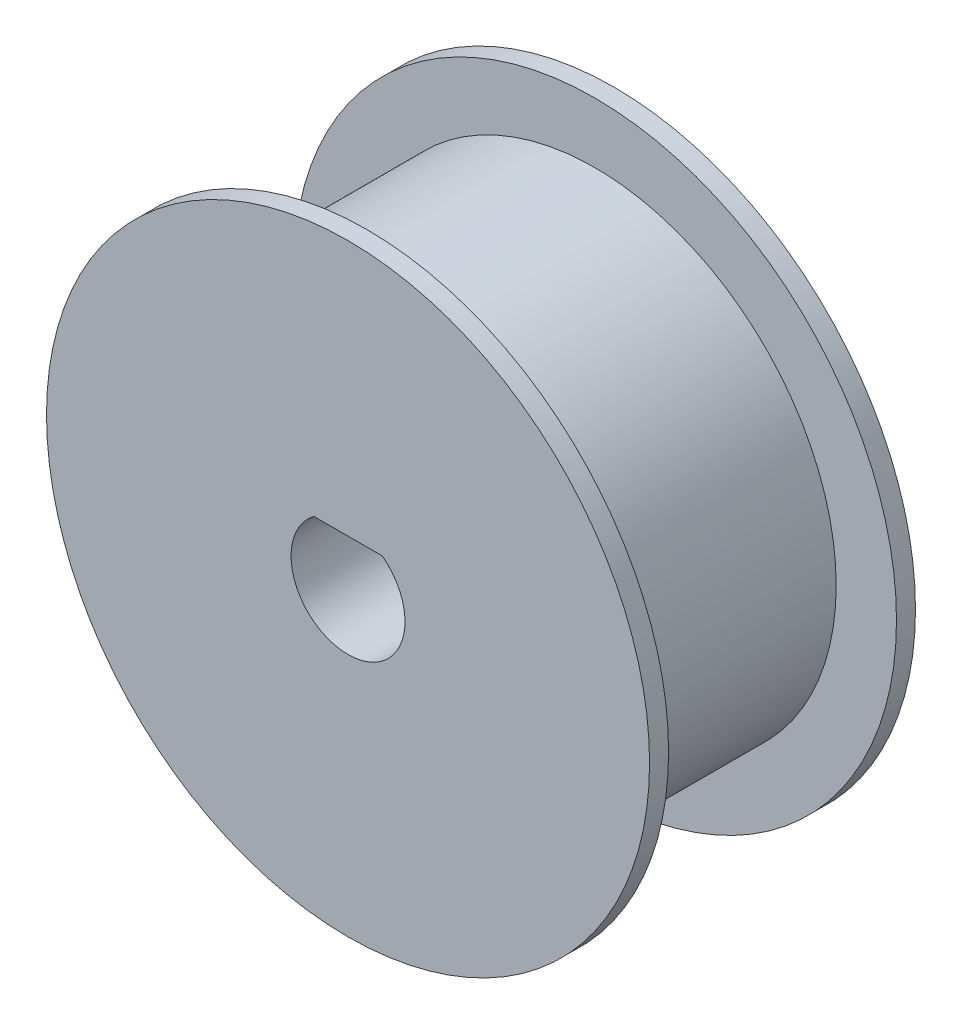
ISO-10303-21;
HEADER;
FILE_DESCRIPTION(('STEP AP214'),'2;1');
FILE_NAME('part.step','',(''),(''),'','','');
FILE_SCHEMA(('AUTOMOTIVE_DESIGN { 1 0 10303 214 1 1 1 1 }'));
ENDSEC;
DATA;
#1=APPLICATION_CONTEXT('core data for automotive mechanical design processes');
#2=APPLICATION_PROTOCOL_DEFINITION('international standard','automotive_design',2000,#1);
#3=PRODUCT_CONTEXT('',#1,'mechanical');
#4=PRODUCT('Part','Part','',(#3));
#5=PRODUCT_RELATED_PRODUCT_CATEGORY('part','',(#4));
#6=PRODUCT_DEFINITION_FORMATION('','',#4);
#7=PRODUCT_DEFINITION_CONTEXT('part definition',#1,'design');
#8=PRODUCT_DEFINITION('design','',#6,#7);
#9=PRODUCT_DEFINITION_SHAPE('','',#8);
#10=(LENGTH_UNIT() NAMED_UNIT(*) SI_UNIT(.MILLI.,.METRE.));
#11=(NAMED_UNIT(*) PLANE_ANGLE_UNIT() SI_UNIT($,.RADIAN.));
#12=(NAMED_UNIT(*) SI_UNIT($,.STERADIAN.) SOLID_ANGLE_UNIT());
#13=UNCERTAINTY_MEASURE_WITH_UNIT(LENGTH_MEASURE(1.E-05),#10,'distance_accuracy_value','');
#14=(GEOMETRIC_REPRESENTATION_CONTEXT(3) GLOBAL_UNCERTAINTY_ASSIGNED_CONTEXT((#13)) GLOBAL_UNIT_ASSIGNED_CONTEXT((#10,
#11,#12)) REPRESENTATION_CONTEXT('',''));
#15=CARTESIAN_POINT('',(0.,0.,0.));
#16=DIRECTION('',(0.,0.,1.));
#17=DIRECTION('',(1.,0.,0.));
#18=AXIS2_PLACEMENT_3D('',#15,#16,#17);
#19=CARTESIAN_POINT('',(0.,0.,12.));
#20=DIRECTION('',(0.,0.,-1.));
#21=DIRECTION('',(-1.,0.,0.));
#22=AXIS2_PLACEMENT_3D('',#19,#20,#21);
#23=CYLINDRICAL_SURFACE('',#22,12.7);
#24=CARTESIAN_POINT('',(0.,0.,12.));
#25=DIRECTION('',(0.,0.,1.));
#26=DIRECTION('',(1.,0.,0.));
#27=AXIS2_PLACEMENT_3D('',#24,#25,#26);
#28=CIRCLE('',#27,12.7);
#29=CARTESIAN_POINT('',(12.7,0.,12.));
#30=VERTEX_POINT('',#29);
#31=EDGE_CURVE('E11',#30,#30,#28,.T.);
#32=ORIENTED_EDGE('',*,*,#31,.F.);
#33=EDGE_LOOP('',(#32));
#34=FACE_BOUND('',#33,.T.);
#35=CARTESIAN_POINT('',(0.,0.,0.));
#36=DIRECTION('',(0.,0.,1.));
#37=DIRECTION('',(1.,0.,0.));
#38=AXIS2_PLACEMENT_3D('',#35,#36,#37);
#39=CIRCLE('',#38,12.7);
#40=CARTESIAN_POINT('',(12.7,0.,0.));
#41=VERTEX_POINT('',#40);
#42=EDGE_CURVE('E48',#41,#41,#39,.T.);
#43=ORIENTED_EDGE('',*,*,#42,.T.);
#44=EDGE_LOOP('',(#43));
#45=FACE_BOUND('',#44,.T.);
#46=ADVANCED_FACE('F45',(#34,#45),#23,.T.);
#47=CARTESIAN_POINT('',(0.,0.,12.));
#48=DIRECTION('',(0.,0.,-1.));
#49=DIRECTION('',(-1.,0.,0.));
#50=AXIS2_PLACEMENT_3D('',#47,#48,#49);
#51=CYLINDRICAL_SURFACE('',#50,3.);
#52=DIRECTION('',(0.,0.,1.));
#53=VECTOR('',#52,1.);
#54=CARTESIAN_POINT('',(-1.8,2.4,-4.64965751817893));
#55=LINE('',#54,#53);
#56=CARTESIAN_POINT('',(-1.8,2.4,-1.));
#57=VERTEX_POINT('',#56);
#58=CARTESIAN_POINT('',(-1.8,2.4,13.));
#59=VERTEX_POINT('',#58);
#60=EDGE_CURVE('E61',#57,#59,#55,.T.);
#61=ORIENTED_EDGE('',*,*,#60,.T.);
#62=CARTESIAN_POINT('',(0.,0.,13.));
#63=DIRECTION('',(0.,0.,1.));
#64=DIRECTION('',(1.,0.,0.));
#65=AXIS2_PLACEMENT_3D('',#62,#63,#64);
#66=CIRCLE('',#65,3.);
#67=CARTESIAN_POINT('',(1.8,2.4,13.));
#68=VERTEX_POINT('',#67);
#69=EDGE_CURVE('E65',#59,#68,#66,.T.);
#70=ORIENTED_EDGE('',*,*,#69,.T.);
#71=DIRECTION('',(0.,0.,1.));
#72=VECTOR('',#71,1.);
#73=CARTESIAN_POINT('',(1.8,2.4,-4.64965751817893));
#74=LINE('',#73,#72);
#75=CARTESIAN_POINT('',(1.8,2.4,-1.));
#76=VERTEX_POINT('',#75);
#77=EDGE_CURVE('E80',#76,#68,#74,.T.);
#78=ORIENTED_EDGE('',*,*,#77,.F.);
#79=CARTESIAN_POINT('',(0.,0.,-1.));
#80=DIRECTION('',(0.,0.,-1.));
#81=DIRECTION('',(-1.,0.,0.));
#82=AXIS2_PLACEMENT_3D('',#79,#80,#81);
#83=CIRCLE('',#82,3.);
#84=EDGE_CURVE('E73',#76,#57,#83,.T.);
#85=ORIENTED_EDGE('',*,*,#84,.T.);
#86=EDGE_LOOP('',(#61,#70,#78,#85));
#87=FACE_BOUND('',#86,.T.);
#88=ADVANCED_FACE('F81',(#87),#51,.F.);
#89=CARTESIAN_POINT('',(0.,0.,13.));
#90=DIRECTION('',(0.,0.,1.));
#91=DIRECTION('',(1.,0.,0.));
#92=AXIS2_PLACEMENT_3D('',#89,#90,#91);
#93=PLANE('',#92);
#94=CARTESIAN_POINT('',(0.,0.,13.));
#95=DIRECTION('',(0.,0.,1.));
#96=DIRECTION('',(1.,0.,0.));
#97=AXIS2_PLACEMENT_3D('',#94,#95,#96);
#98=CIRCLE('',#97,15.875);
#99=CARTESIAN_POINT('',(15.875,0.,13.));
#100=VERTEX_POINT('',#99);
#101=EDGE_CURVE('E54',#100,#100,#98,.T.);
#102=ORIENTED_EDGE('',*,*,#101,.T.);
#103=EDGE_LOOP('',(#102));
#104=FACE_BOUND('',#103,.T.);
#105=ORIENTED_EDGE('',*,*,#69,.F.);
#106=DIRECTION('',(1.,0.,0.));
#107=VECTOR('',#106,1.);
#108=CARTESIAN_POINT('',(-1.8,2.4,13.));
#109=LINE('',#108,#107);
#110=EDGE_CURVE('E89',#59,#68,#109,.T.);
#111=ORIENTED_EDGE('',*,*,#110,.T.);
#112=EDGE_LOOP('',(#105,#111));
#113=FACE_BOUND('',#112,.T.);
#114=ADVANCED_FACE('F117',(#104,#113),#93,.T.);
#115=CARTESIAN_POINT('',(0.,0.,12.));
#116=DIRECTION('',(0.,0.,1.));
#117=DIRECTION('',(1.,0.,0.));
#118=AXIS2_PLACEMENT_3D('',#115,#116,#117);
#119=PLANE('',#118);
#120=ORIENTED_EDGE('',*,*,#31,.T.);
#121=EDGE_LOOP('',(#120));
#122=FACE_BOUND('',#121,.T.);
#123=CARTESIAN_POINT('',(0.,0.,12.));
#124=DIRECTION('',(0.,0.,1.));
#125=DIRECTION('',(1.,0.,0.));
#126=AXIS2_PLACEMENT_3D('',#123,#124,#125);
#127=CIRCLE('',#126,15.875);
#128=CARTESIAN_POINT('',(15.875,0.,12.));
#129=VERTEX_POINT('',#128);
#130=EDGE_CURVE('E105',#129,#129,#127,.T.);
#131=ORIENTED_EDGE('',*,*,#130,.F.);
#132=EDGE_LOOP('',(#131));
#133=FACE_BOUND('',#132,.T.);
#134=ADVANCED_FACE('F115',(#122,#133),#119,.F.);
#135=CARTESIAN_POINT('',(0.,0.,13.));
#136=DIRECTION('',(0.,0.,-1.));
#137=DIRECTION('',(-1.,0.,0.));
#138=AXIS2_PLACEMENT_3D('',#135,#136,#137);
#139=CYLINDRICAL_SURFACE('',#138,15.875);
#140=ORIENTED_EDGE('',*,*,#101,.F.);
#141=EDGE_LOOP('',(#140));
#142=FACE_BOUND('',#141,.T.);
#143=ORIENTED_EDGE('',*,*,#130,.T.);
#144=EDGE_LOOP('',(#143));
#145=FACE_BOUND('',#144,.T.);
#146=ADVANCED_FACE('F113',(#142,#145),#139,.T.);
#147=CARTESIAN_POINT('',(0.,0.,-1.));
#148=DIRECTION('',(0.,0.,-1.));
#149=DIRECTION('',(-1.,0.,0.));
#150=AXIS2_PLACEMENT_3D('',#147,#148,#149);
#151=PLANE('',#150);
#152=CARTESIAN_POINT('',(0.,0.,-1.));
#153=DIRECTION('',(0.,0.,-1.));
#154=DIRECTION('',(-1.,0.,0.));
#155=AXIS2_PLACEMENT_3D('',#152,#153,#154);
#156=CIRCLE('',#155,15.875);
#157=CARTESIAN_POINT('',(-15.875,0.,-1.));
#158=VERTEX_POINT('',#157);
#159=EDGE_CURVE('E96',#158,#158,#156,.T.);
#160=ORIENTED_EDGE('',*,*,#159,.T.);
#161=EDGE_LOOP('',(#160));
#162=FACE_BOUND('',#161,.T.);
#163=ORIENTED_EDGE('',*,*,#84,.F.);
#164=DIRECTION('',(1.,0.,0.));
#165=VECTOR('',#164,1.);
#166=CARTESIAN_POINT('',(-1.8,2.4,-1.));
#167=LINE('',#166,#165);
#168=EDGE_CURVE('E76',#57,#76,#167,.T.);
#169=ORIENTED_EDGE('',*,*,#168,.F.);
#170=EDGE_LOOP('',(#163,#169));
#171=FACE_BOUND('',#170,.T.);
#172=ADVANCED_FACE('F74',(#162,#171),#151,.T.);
#173=CARTESIAN_POINT('',(0.,0.,0.));
#174=DIRECTION('',(0.,0.,-1.));
#175=DIRECTION('',(-1.,0.,0.));
#176=AXIS2_PLACEMENT_3D('',#173,#174,#175);
#177=PLANE('',#176);
#178=ORIENTED_EDGE('',*,*,#42,.F.);
#179=EDGE_LOOP('',(#178));
#180=FACE_BOUND('',#179,.T.);
#181=CARTESIAN_POINT('',(0.,0.,0.));
#182=DIRECTION('',(0.,0.,-1.));
#183=DIRECTION('',(-1.,0.,0.));
#184=AXIS2_PLACEMENT_3D('',#181,#182,#183);
#185=CIRCLE('',#184,15.875);
#186=CARTESIAN_POINT('',(-15.875,0.,0.));
#187=VERTEX_POINT('',#186);
#188=EDGE_CURVE('E78',#187,#187,#185,.T.);
#189=ORIENTED_EDGE('',*,*,#188,.F.);
#190=EDGE_LOOP('',(#189));
#191=FACE_BOUND('',#190,.T.);
#192=ADVANCED_FACE('F139',(#180,#191),#177,.F.);
#193=CARTESIAN_POINT('',(0.,0.,-1.));
#194=DIRECTION('',(0.,0.,1.));
#195=DIRECTION('',(1.,0.,0.));
#196=AXIS2_PLACEMENT_3D('',#193,#194,#195);
#197=CYLINDRICAL_SURFACE('',#196,15.875);
#198=ORIENTED_EDGE('',*,*,#159,.F.);
#199=EDGE_LOOP('',(#198));
#200=FACE_BOUND('',#199,.T.);
#201=ORIENTED_EDGE('',*,*,#188,.T.);
#202=EDGE_LOOP('',(#201));
#203=FACE_BOUND('',#202,.T.);
#204=ADVANCED_FACE('F142',(#200,#203),#197,.T.);
#205=CARTESIAN_POINT('',(-1.8,2.4,-4.64965751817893));
#206=DIRECTION('',(0.,-1.,0.));
#207=DIRECTION('',(0.,0.,-1.));
#208=AXIS2_PLACEMENT_3D('',#205,#206,#207);
#209=PLANE('',#208);
#210=ORIENTED_EDGE('',*,*,#60,.F.);
#211=ORIENTED_EDGE('',*,*,#168,.T.);
#212=ORIENTED_EDGE('',*,*,#77,.T.);
#213=ORIENTED_EDGE('',*,*,#110,.F.);
#214=EDGE_LOOP('',(#210,#211,#212,#213));
#215=FACE_BOUND('',#214,.T.);
#216=ADVANCED_FACE('F87',(#215),#209,.T.);
#217=CLOSED_SHELL('',(#46,#88,#114,#134,#146,#172,#192,#204,#216));
#218=MANIFOLD_SOLID_BREP('B2',#217);
#219=ADVANCED_BREP_SHAPE_REPRESENTATION('',(#18,#218),#14);
#220=SHAPE_DEFINITION_REPRESENTATION(#9,#219);
ENDSEC;
END-ISO-10303-21;
